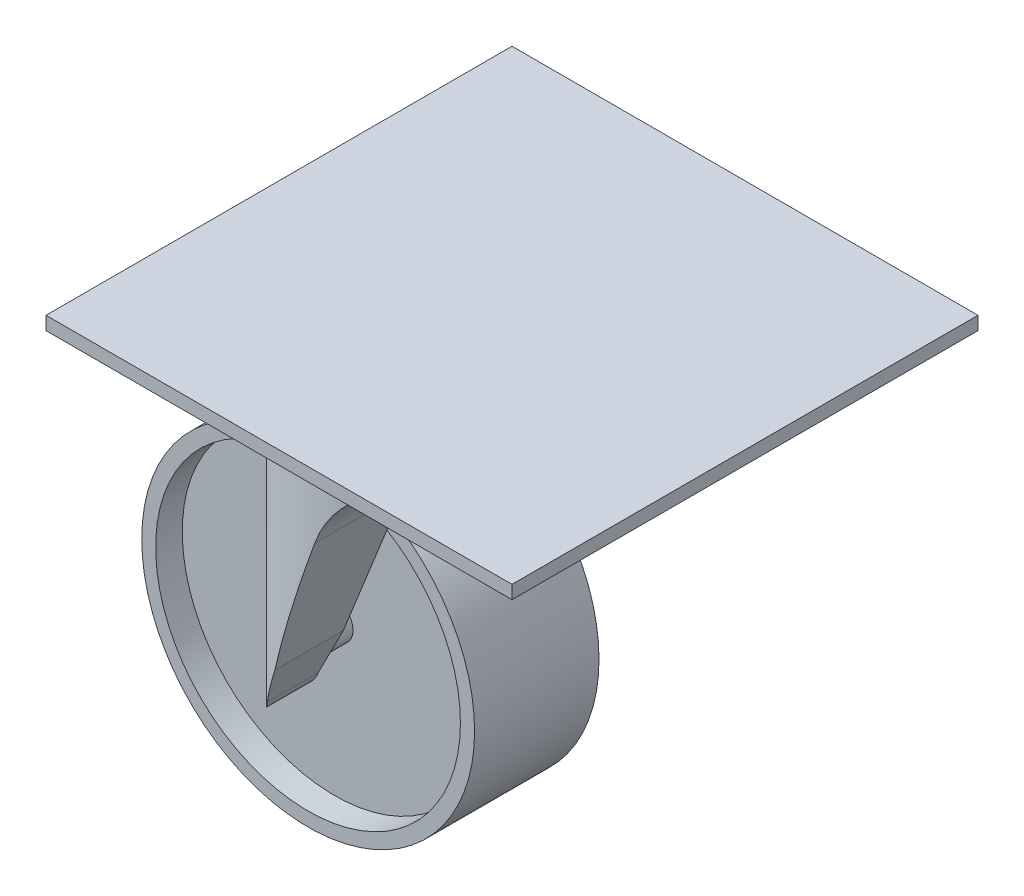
from build123d import *

# Parameters (mm, degrees)
SKETCH2_W           = 35
SKETCH2_H           = 35
BOSS_EXTRUDE1_DEPTH = 1
SKETCH3_R           = 12.5
BOSS_EXTRUDE2_DEPTH = 25
CUT_EXTRUDE1_DEPTH  = 56.452682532
SKETCH7_W           = 11.345885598
SKETCH7_H           = 20.372080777
CUT_EXTRUDE4_DEPTH  = 56.168838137
BOSS_EXTRUDE3_REACH = 50.942
SKETCH8_R           = 0.842065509
SKETCH9_R           = 12.5
BOSS_EXTRUDE4_DEPTH = 11.345885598
SKETCH12_R          = 12.5
SKETCH12_R_2        = 1.574166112
CUT_EXTRUDE6_DEPTH  = 1
SKETCH11_R          = 11.445670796
SKETCH11_R_2        = 1.378562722
CUT_EXTRUDE7_DEPTH  = 3
CUT_EXTRUDE10_START = -1
SKETCH17_R          = 12.5
SKETCH17_R_2        = 1.574166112
CUT_EXTRUDE10_DEPTH = 1
SKETCH19_R          = 11.445670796
SKETCH19_R_2        = 1.378562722
CUT_EXTRUDE11_DEPTH = 3


with BuildPart() as part:
    # Sketch2 → Boss-Extrude1 (new body)
    with BuildSketch(Plane(origin=(0, 0, 0), x_dir=(1, 0, 0), z_dir=(0, 1, 0))):
        with Locations((17.5, 17.5)):
            Rectangle(SKETCH2_W, SKETCH2_H)
    extrude(amount=BOSS_EXTRUDE1_DEPTH)

    # Sketch3 → Boss-Extrude2 (add)
    with BuildSketch(Plane.XZ):
        with Locations(Location((17.5, -16.723634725, 0), (0, 0, 270))):
            Circle(SKETCH3_R)
    extrude(amount=BOSS_EXTRUDE2_DEPTH)

    # Sketch5 → Cut-Extrude1 (cut, through all)
    with BuildSketch(Plane.XY):
        with BuildLine():
            Line((5, -2.35944727), (8.333801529, -2.35944727))
            Line((8.333801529, -2.35944727), (5.655095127, -22.14281018))
            ThreePointArc((5.655095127, -22.14281018), (7.14719395, -24.311863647), (9.449929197, -23.035712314))
            Line((9.449929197, -23.035712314), (11.347346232, -19.324587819))
            Line((11.347346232, -19.324587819), (15.854672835, -8.063163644))
            ThreePointArc((15.854672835, -8.063163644), (17.949005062, -4.733393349), (21.085560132, -2.35944727))
            Line((21.085560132, -2.35944727), (30, -2))
            Line((30, -2), (30, -25))
            Line((30, -25), (5, -25))
            Line((5, -25), (5, -2.35944727))
        make_face()
    extrude(amount=-CUT_EXTRUDE1_DEPTH, mode=Mode.SUBTRACT)

    # Sketch7 → Cut-Extrude4 (cut, through all)
    with BuildSketch(Plane(origin=(0, 0, 0), x_dir=(0, 0, -1), z_dir=(1, 0, 0))):
        with Locations((16.657119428, -14.822445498)):
            Rectangle(SKETCH7_W, SKETCH7_H)
    extrude(amount=CUT_EXTRUDE4_DEPTH, mode=Mode.SUBTRACT)

    # Sketch8 → Boss-Extrude3 (add, up to next)
    with BuildSketch(Plane(origin=(0, 0, -10.984176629), x_dir=(-1, 0, 0), z_dir=(0, 0, -1)), mode=Mode.PRIVATE) as boss_extrude3_sk1:
        with Locations(Location((-7.706366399, -21.935380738, 0), (0, 0, 180))):
            Circle(SKETCH8_R)
    boss_extrude3_tool1 = extrude(boss_extrude3_sk1.sketch, amount=BOSS_EXTRUDE3_REACH, mode=Mode.PRIVATE) - part.part
    add(boss_extrude3_tool1.solids().sort_by_distance((7.706366, -21.935381, -10.984177))[0])

    # Sketch9 → Boss-Extrude4 (add)
    with BuildSketch(Plane.XY.offset(-22.330062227)):
        with Locations(Location((7.706366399, -21.935380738, 0), (0, 0, 91.51853721))):
            Circle(SKETCH9_R)
    extrude(amount=BOSS_EXTRUDE4_DEPTH)

    # Sketch12 → Cut-Extrude6 (cut)
    with BuildSketch(Plane(origin=(0, 0, -22.330062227), x_dir=(-1, 0, 0), z_dir=(0, 0, -1))):
        with Locations((-7.706366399, -21.935380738)):
            Circle(SKETCH12_R)
        with Locations((-7.706366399, -21.935380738)):
            Circle(SKETCH12_R_2, mode=Mode.SUBTRACT)
    extrude(amount=-CUT_EXTRUDE6_DEPTH, mode=Mode.SUBTRACT)

    # Sketch11 → Cut-Extrude7 (cut)
    with BuildSketch(Plane(origin=(0, 0, -22.330062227), x_dir=(-1, 0, 0), z_dir=(0, 0, -1))):
        with Locations((-7.706366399, -21.935380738)):
            Circle(SKETCH11_R)
        with Locations((-7.706366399, -21.935380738)):
            Circle(SKETCH11_R_2, mode=Mode.SUBTRACT)
    extrude(amount=-CUT_EXTRUDE7_DEPTH, mode=Mode.SUBTRACT)

    # Sketch17 → Cut-Extrude10 (cut)
    with BuildSketch(Plane.XY.offset(-10.984176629).offset(CUT_EXTRUDE10_START)):
        with Locations(Location((7.706366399, -21.935380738, 0), (0, 0, 180))):
            Circle(SKETCH17_R)
        with Locations((7.706366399, -21.935380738)):
            Circle(SKETCH17_R_2, mode=Mode.SUBTRACT)
    extrude(amount=CUT_EXTRUDE10_DEPTH, mode=Mode.SUBTRACT)

    # Sketch19 → Cut-Extrude11 (cut)
    with BuildSketch(Plane(origin=(0, 0, -10.984176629), x_dir=(-1, 0, 0), z_dir=(0, 0, -1))):
        with Locations(Location((-7.695877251, -21.944537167, 0), (0, 0, 180))):
            Circle(SKETCH19_R)
        with Locations(Location((-7.695877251, -21.944537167, 0), (0, 0, 340.603396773))):
            Circle(SKETCH19_R_2, mode=Mode.SUBTRACT)
    extrude(amount=CUT_EXTRUDE11_DEPTH, mode=Mode.SUBTRACT)


solid = part.part
